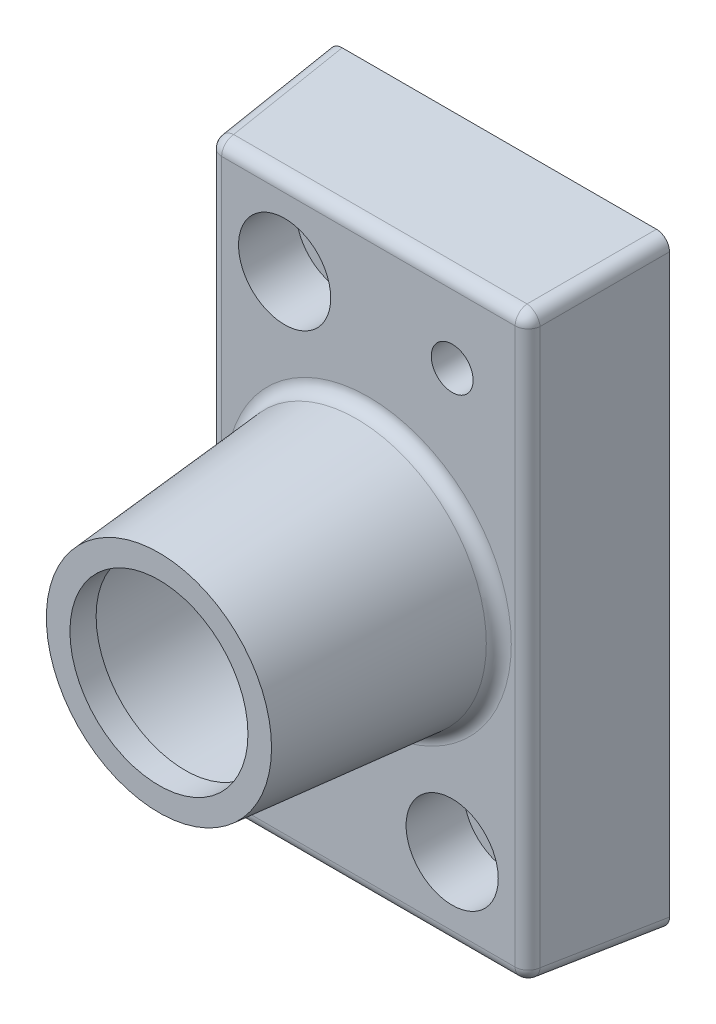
ISO-10303-21;
HEADER;
FILE_DESCRIPTION(('STEP AP214'),'2;1');
FILE_NAME('part.step','',(''),(''),'','','');
FILE_SCHEMA(('AUTOMOTIVE_DESIGN { 1 0 10303 214 1 1 1 1 }'));
ENDSEC;
DATA;
#1=APPLICATION_CONTEXT('core data for automotive mechanical design processes');
#2=APPLICATION_PROTOCOL_DEFINITION('international standard','automotive_design',2000,#1);
#3=PRODUCT_CONTEXT('',#1,'mechanical');
#4=PRODUCT('Part','Part','',(#3));
#5=PRODUCT_RELATED_PRODUCT_CATEGORY('part','',(#4));
#6=PRODUCT_DEFINITION_FORMATION('','',#4);
#7=PRODUCT_DEFINITION_CONTEXT('part definition',#1,'design');
#8=PRODUCT_DEFINITION('design','',#6,#7);
#9=PRODUCT_DEFINITION_SHAPE('','',#8);
#10=(LENGTH_UNIT() NAMED_UNIT(*) SI_UNIT(.MILLI.,.METRE.));
#11=(NAMED_UNIT(*) PLANE_ANGLE_UNIT() SI_UNIT($,.RADIAN.));
#12=(NAMED_UNIT(*) SI_UNIT($,.STERADIAN.) SOLID_ANGLE_UNIT());
#13=UNCERTAINTY_MEASURE_WITH_UNIT(LENGTH_MEASURE(1.E-05),#10,'distance_accuracy_value','');
#14=(GEOMETRIC_REPRESENTATION_CONTEXT(3) GLOBAL_UNCERTAINTY_ASSIGNED_CONTEXT((#13)) GLOBAL_UNIT_ASSIGNED_CONTEXT((#10,
#11,#12)) REPRESENTATION_CONTEXT('',''));
#15=CARTESIAN_POINT('',(0.,0.,0.));
#16=DIRECTION('',(0.,0.,1.));
#17=DIRECTION('',(1.,0.,0.));
#18=AXIS2_PLACEMENT_3D('',#15,#16,#17);
#19=CARTESIAN_POINT('',(-32.4999999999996,57.5,25.));
#20=DIRECTION('',(0.,0.,1.00000000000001));
#21=DIRECTION('',(1.00000000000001,0.,0.));
#22=AXIS2_PLACEMENT_3D('',#19,#20,#21);
#23=PLANE('',#22);
#24=CARTESIAN_POINT('',(-16.0000000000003,-40.,25.));
#25=DIRECTION('',(0.,0.,1.00000000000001));
#26=DIRECTION('',(1.00000000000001,0.,0.));
#27=AXIS2_PLACEMENT_3D('',#24,#25,#26);
#28=CIRCLE('',#27,4.);
#29=CARTESIAN_POINT('',(-12.0000000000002,-40.,25.));
#30=VERTEX_POINT('',#29);
#31=EDGE_CURVE('E537',#30,#30,#28,.T.);
#32=ORIENTED_EDGE('',*,*,#31,.F.);
#33=EDGE_LOOP('',(#32));
#34=FACE_BOUND('',#33,.T.);
#35=CARTESIAN_POINT('',(16.0000000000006,40.,25.));
#36=DIRECTION('',(0.,0.,1.00000000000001));
#37=DIRECTION('',(1.00000000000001,0.,0.));
#38=AXIS2_PLACEMENT_3D('',#35,#36,#37);
#39=CIRCLE('',#38,4.);
#40=CARTESIAN_POINT('',(20.0000000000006,40.,25.));
#41=VERTEX_POINT('',#40);
#42=EDGE_CURVE('E539',#41,#41,#39,.T.);
#43=ORIENTED_EDGE('',*,*,#42,.F.);
#44=EDGE_LOOP('',(#43));
#45=FACE_BOUND('',#44,.T.);
#46=CARTESIAN_POINT('',(16.,-40.,25.));
#47=DIRECTION('',(0.,0.,1.00000000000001));
#48=DIRECTION('',(1.00000000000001,0.,0.));
#49=AXIS2_PLACEMENT_3D('',#46,#47,#48);
#50=CIRCLE('',#49,8.8);
#51=CARTESIAN_POINT('',(24.8000000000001,-40.,25.));
#52=VERTEX_POINT('',#51);
#53=EDGE_CURVE('E556',#52,#52,#50,.T.);
#54=ORIENTED_EDGE('',*,*,#53,.F.);
#55=EDGE_LOOP('',(#54));
#56=FACE_BOUND('',#55,.T.);
#57=CARTESIAN_POINT('',(-15.9999999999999,40.,25.));
#58=DIRECTION('',(0.,0.,1.00000000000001));
#59=DIRECTION('',(1.00000000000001,0.,0.));
#60=AXIS2_PLACEMENT_3D('',#57,#58,#59);
#61=CIRCLE('',#60,8.8);
#62=CARTESIAN_POINT('',(-7.19999999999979,40.0000000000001,25.));
#63=VERTEX_POINT('',#62);
#64=EDGE_CURVE('E568',#63,#63,#61,.T.);
#65=ORIENTED_EDGE('',*,*,#64,.F.);
#66=EDGE_LOOP('',(#65));
#67=FACE_BOUND('',#66,.T.);
#68=CARTESIAN_POINT('',(0.,0.,25.));
#69=DIRECTION('',(0.,0.,1.00000000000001));
#70=DIRECTION('',(1.00000000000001,0.,0.));
#71=AXIS2_PLACEMENT_3D('',#68,#69,#70);
#72=CIRCLE('',#71,27.2908279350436);
#73=CARTESIAN_POINT('',(27.2908279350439,0.,25.));
#74=VERTEX_POINT('',#73);
#75=EDGE_CURVE('E141',#74,#74,#72,.F.);
#76=ORIENTED_EDGE('',*,*,#75,.T.);
#77=EDGE_LOOP('',(#76));
#78=FACE_BOUND('',#77,.T.);
#79=DIRECTION('',(0.,-1.,0.));
#80=VECTOR('',#79,1.);
#81=CARTESIAN_POINT('',(28.021955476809,55.312783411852,25.));
#82=LINE('',#81,#80);
#83=CARTESIAN_POINT('',(28.0219554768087,-53.0219554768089,25.));
#84=VERTEX_POINT('',#83);
#85=CARTESIAN_POINT('',(28.021955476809,53.0219554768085,25.));
#86=VERTEX_POINT('',#85);
#87=EDGE_CURVE('E139',#84,#86,#82,.F.);
#88=ORIENTED_EDGE('',*,*,#87,.T.);
#89=DIRECTION('',(1.00000000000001,0.,0.));
#90=VECTOR('',#89,1.);
#91=CARTESIAN_POINT('',(-30.3127834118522,53.0219554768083,25.));
#92=LINE('',#91,#90);
#93=CARTESIAN_POINT('',(-28.0219554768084,53.0219554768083,25.));
#94=VERTEX_POINT('',#93);
#95=EDGE_CURVE('E111',#86,#94,#92,.F.);
#96=ORIENTED_EDGE('',*,*,#95,.T.);
#97=DIRECTION('',(0.,1.,0.));
#98=VECTOR('',#97,1.);
#99=CARTESIAN_POINT('',(-28.0219554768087,-55.312783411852,25.));
#100=LINE('',#99,#98);
#101=CARTESIAN_POINT('',(-28.0219554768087,-53.0219554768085,25.));
#102=VERTEX_POINT('',#101);
#103=EDGE_CURVE('E129',#94,#102,#100,.F.);
#104=ORIENTED_EDGE('',*,*,#103,.T.);
#105=DIRECTION('',(-1.00000000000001,0.,0.));
#106=VECTOR('',#105,1.);
#107=CARTESIAN_POINT('',(30.3127834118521,-53.0219554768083,25.));
#108=LINE('',#107,#106);
#109=EDGE_CURVE('E135',#102,#84,#108,.F.);
#110=ORIENTED_EDGE('',*,*,#109,.T.);
#111=EDGE_LOOP('',(#88,#96,#104,#110));
#112=FACE_BOUND('',#111,.T.);
#113=ADVANCED_FACE('F29',(#34,#45,#56,#67,#78,#112),#23,.T.);
#114=CARTESIAN_POINT('',(-32.4999999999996,57.5,0.));
#115=DIRECTION('',(-0.996194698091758,0.,0.0871557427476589));
#116=DIRECTION('',(0.0871557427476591,0.,0.996194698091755));
#117=AXIS2_PLACEMENT_3D('',#114,#115,#116);
#118=PLANE('',#117);
#119=DIRECTION('',(0.,-1.,0.));
#120=VECTOR('',#119,1.);
#121=CARTESIAN_POINT('',(-30.5124422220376,55.3127834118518,22.7178893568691));
#122=LINE('',#121,#120);
#123=CARTESIAN_POINT('',(-30.5124422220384,-53.0219554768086,22.7178893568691));
#124=VERTEX_POINT('',#123);
#125=CARTESIAN_POINT('',(-30.512442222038,53.0219554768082,22.7178893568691));
#126=VERTEX_POINT('',#125);
#127=EDGE_CURVE('E45',#124,#126,#122,.F.);
#128=ORIENTED_EDGE('',*,*,#127,.T.);
#129=DIRECTION('',(0.0868265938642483,-0.0868265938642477,0.992432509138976));
#130=VECTOR('',#129,1.);
#131=CARTESIAN_POINT('',(-32.5187754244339,55.0282886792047,-0.214604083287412));
#132=LINE('',#131,#130);
#133=CARTESIAN_POINT('',(-32.4999999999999,55.0095132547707,0.));
#134=VERTEX_POINT('',#133);
#135=EDGE_CURVE('E167',#126,#134,#132,.F.);
#136=ORIENTED_EDGE('',*,*,#135,.T.);
#137=DIRECTION('',(0.,-1.,0.));
#138=VECTOR('',#137,1.);
#139=CARTESIAN_POINT('',(-32.4999999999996,57.5,0.));
#140=LINE('',#139,#138);
#141=CARTESIAN_POINT('',(-32.5000000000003,-55.0095132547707,0.));
#142=VERTEX_POINT('',#141);
#143=EDGE_CURVE('E181',#134,#142,#140,.T.);
#144=ORIENTED_EDGE('',*,*,#143,.T.);
#145=DIRECTION('',(0.0868265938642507,0.0868265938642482,0.992432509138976));
#146=VECTOR('',#145,1.);
#147=CARTESIAN_POINT('',(-31.6518068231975,-54.1613200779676,9.69489237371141));
#148=LINE('',#147,#146);
#149=EDGE_CURVE('E50',#142,#124,#148,.T.);
#150=ORIENTED_EDGE('',*,*,#149,.T.);
#151=EDGE_LOOP('',(#128,#136,#144,#150));
#152=FACE_BOUND('',#151,.T.);
#153=ADVANCED_FACE('F268',(#152),#118,.T.);
#154=CARTESIAN_POINT('',(-32.5000000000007,-57.5000000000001,0.));
#155=DIRECTION('',(0.,-0.996194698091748,0.0871557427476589));
#156=DIRECTION('',(0.,-0.0871557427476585,-0.996194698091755));
#157=AXIS2_PLACEMENT_3D('',#154,#155,#156);
#158=PLANE('',#157);
#159=DIRECTION('',(1.00000000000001,0.,0.));
#160=VECTOR('',#159,1.);
#161=CARTESIAN_POINT('',(-32.5000000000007,-57.5000000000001,0.));
#162=LINE('',#161,#160);
#163=CARTESIAN_POINT('',(-30.0095132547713,-57.5000000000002,0.));
#164=VERTEX_POINT('',#163);
#165=CARTESIAN_POINT('',(30.0095132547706,-57.4999999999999,0.));
#166=VERTEX_POINT('',#165);
#167=EDGE_CURVE('E218',#164,#166,#162,.T.);
#168=ORIENTED_EDGE('',*,*,#167,.T.);
#169=DIRECTION('',(-0.0868265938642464,0.0868265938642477,0.992432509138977));
#170=VECTOR('',#169,1.);
#171=CARTESIAN_POINT('',(29.5382629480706,-57.0287496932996,5.38641565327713));
#172=LINE('',#171,#170);
#173=CARTESIAN_POINT('',(28.0219554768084,-55.5124422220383,22.7178893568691));
#174=VERTEX_POINT('',#173);
#175=EDGE_CURVE('E163',#166,#174,#172,.T.);
#176=ORIENTED_EDGE('',*,*,#175,.T.);
#177=DIRECTION('',(1.00000000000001,0.,0.));
#178=VECTOR('',#177,1.);
#179=CARTESIAN_POINT('',(-30.3127834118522,-55.5124422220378,22.7178893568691));
#180=LINE('',#179,#178);
#181=CARTESIAN_POINT('',(-28.021955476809,-55.5124422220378,22.7178893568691));
#182=VERTEX_POINT('',#181);
#183=EDGE_CURVE('E161',#174,#182,#180,.F.);
#184=ORIENTED_EDGE('',*,*,#183,.T.);
#185=DIRECTION('',(0.0868265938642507,0.0868265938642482,0.992432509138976));
#186=VECTOR('',#185,1.);
#187=CARTESIAN_POINT('',(-30.0282886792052,-57.5187754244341,-0.214604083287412));
#188=LINE('',#187,#186);
#189=EDGE_CURVE('E159',#182,#164,#188,.F.);
#190=ORIENTED_EDGE('',*,*,#189,.T.);
#191=EDGE_LOOP('',(#168,#176,#184,#190));
#192=FACE_BOUND('',#191,.T.);
#193=ADVANCED_FACE('F31',(#192),#158,.T.);
#194=CARTESIAN_POINT('',(32.5000000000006,57.5000000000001,0.));
#195=DIRECTION('',(0.996194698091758,0.,0.0871557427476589));
#196=DIRECTION('',(0.0871557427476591,0.,-0.996194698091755));
#197=AXIS2_PLACEMENT_3D('',#194,#195,#196);
#198=PLANE('',#197);
#199=DIRECTION('',(0.,1.,0.));
#200=VECTOR('',#199,1.);
#201=CARTESIAN_POINT('',(32.5000000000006,57.5000000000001,0.));
#202=LINE('',#201,#200);
#203=CARTESIAN_POINT('',(32.5000000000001,-55.0095132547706,0.));
#204=VERTEX_POINT('',#203);
#205=CARTESIAN_POINT('',(32.5000000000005,55.0095132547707,0.));
#206=VERTEX_POINT('',#205);
#207=EDGE_CURVE('E187',#204,#206,#202,.T.);
#208=ORIENTED_EDGE('',*,*,#207,.T.);
#209=DIRECTION('',(-0.0868265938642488,-0.0868265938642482,0.992432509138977));
#210=VECTOR('',#209,1.);
#211=CARTESIAN_POINT('',(32.5187754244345,55.0282886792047,-0.214604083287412));
#212=LINE('',#211,#210);
#213=CARTESIAN_POINT('',(30.512442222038,53.0219554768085,22.7178893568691));
#214=VERTEX_POINT('',#213);
#215=EDGE_CURVE('E157',#206,#214,#212,.T.);
#216=ORIENTED_EDGE('',*,*,#215,.T.);
#217=DIRECTION('',(0.,1.,0.));
#218=VECTOR('',#217,1.);
#219=CARTESIAN_POINT('',(30.5124422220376,-55.3127834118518,22.7178893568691));
#220=LINE('',#219,#218);
#221=CARTESIAN_POINT('',(30.5124422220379,-53.0219554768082,22.7178893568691));
#222=VERTEX_POINT('',#221);
#223=EDGE_CURVE('E155',#214,#222,#220,.F.);
#224=ORIENTED_EDGE('',*,*,#223,.T.);
#225=DIRECTION('',(-0.0868265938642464,0.0868265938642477,0.992432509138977));
#226=VECTOR('',#225,1.);
#227=CARTESIAN_POINT('',(31.6518068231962,-54.161320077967,9.69489237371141));
#228=LINE('',#227,#226);
#229=EDGE_CURVE('E153',#222,#204,#228,.F.);
#230=ORIENTED_EDGE('',*,*,#229,.T.);
#231=EDGE_LOOP('',(#208,#216,#224,#230));
#232=FACE_BOUND('',#231,.T.);
#233=ADVANCED_FACE('F246',(#232),#198,.T.);
#234=CARTESIAN_POINT('',(-32.4999999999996,57.5,0.));
#235=DIRECTION('',(0.,0.996194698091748,0.0871557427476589));
#236=DIRECTION('',(0.,-0.0871557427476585,0.996194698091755));
#237=AXIS2_PLACEMENT_3D('',#234,#235,#236);
#238=PLANE('',#237);
#239=DIRECTION('',(-1.00000000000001,0.,0.));
#240=VECTOR('',#239,1.);
#241=CARTESIAN_POINT('',(30.3127834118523,55.5124422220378,22.7178893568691));
#242=LINE('',#241,#240);
#243=CARTESIAN_POINT('',(-28.0219554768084,55.5124422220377,22.7178893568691));
#244=VERTEX_POINT('',#243);
#245=CARTESIAN_POINT('',(28.021955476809,55.5124422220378,22.7178893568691));
#246=VERTEX_POINT('',#245);
#247=EDGE_CURVE('E113',#244,#246,#242,.F.);
#248=ORIENTED_EDGE('',*,*,#247,.T.);
#249=DIRECTION('',(-0.0868265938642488,-0.0868265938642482,0.992432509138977));
#250=VECTOR('',#249,1.);
#251=CARTESIAN_POINT('',(29.538262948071,57.0287496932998,5.38641565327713));
#252=LINE('',#251,#250);
#253=CARTESIAN_POINT('',(30.0095132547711,57.5000000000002,0.));
#254=VERTEX_POINT('',#253);
#255=EDGE_CURVE('E151',#246,#254,#252,.F.);
#256=ORIENTED_EDGE('',*,*,#255,.T.);
#257=DIRECTION('',(-1.00000000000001,0.,0.));
#258=VECTOR('',#257,1.);
#259=CARTESIAN_POINT('',(-32.4999999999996,57.5,0.));
#260=LINE('',#259,#258);
#261=CARTESIAN_POINT('',(-30.0095132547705,57.4999999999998,0.));
#262=VERTEX_POINT('',#261);
#263=EDGE_CURVE('E179',#254,#262,#260,.T.);
#264=ORIENTED_EDGE('',*,*,#263,.T.);
#265=DIRECTION('',(0.0868265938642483,-0.0868265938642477,0.992432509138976));
#266=VECTOR('',#265,1.);
#267=CARTESIAN_POINT('',(-30.0282886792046,57.5187754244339,-0.214604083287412));
#268=LINE('',#267,#266);
#269=EDGE_CURVE('E144',#262,#244,#268,.T.);
#270=ORIENTED_EDGE('',*,*,#269,.T.);
#271=EDGE_LOOP('',(#248,#256,#264,#270));
#272=FACE_BOUND('',#271,.T.);
#273=ADVANCED_FACE('F185',(#272),#238,.T.);
#274=CARTESIAN_POINT('',(-32.4999999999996,57.5,0.));
#275=DIRECTION('',(0.,0.,1.00000000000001));
#276=DIRECTION('',(1.00000000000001,0.,0.));
#277=AXIS2_PLACEMENT_3D('',#274,#275,#276);
#278=PLANE('',#277);
#279=CARTESIAN_POINT('',(-16.0000000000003,-40.,0.));
#280=DIRECTION('',(0.,0.,1.00000000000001));
#281=DIRECTION('',(1.00000000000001,0.,0.));
#282=AXIS2_PLACEMENT_3D('',#279,#280,#281);
#283=CIRCLE('',#282,4.);
#284=CARTESIAN_POINT('',(-12.0000000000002,-40.,0.));
#285=VERTEX_POINT('',#284);
#286=EDGE_CURVE('E535',#285,#285,#283,.T.);
#287=ORIENTED_EDGE('',*,*,#286,.T.);
#288=EDGE_LOOP('',(#287));
#289=FACE_BOUND('',#288,.T.);
#290=CARTESIAN_POINT('',(16.0000000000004,40.,0.));
#291=DIRECTION('',(0.,0.,1.00000000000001));
#292=DIRECTION('',(1.00000000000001,0.,0.));
#293=AXIS2_PLACEMENT_3D('',#290,#291,#292);
#294=CIRCLE('',#293,4.);
#295=CARTESIAN_POINT('',(20.0000000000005,40.,0.));
#296=VERTEX_POINT('',#295);
#297=EDGE_CURVE('E544',#296,#296,#294,.T.);
#298=ORIENTED_EDGE('',*,*,#297,.T.);
#299=EDGE_LOOP('',(#298));
#300=FACE_BOUND('',#299,.T.);
#301=CARTESIAN_POINT('',(16.,-40.,1.36418654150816E-10));
#302=DIRECTION('',(0.,0.,1.00000000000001));
#303=DIRECTION('',(1.00000000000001,0.,0.));
#304=AXIS2_PLACEMENT_3D('',#301,#302,#303);
#305=CIRCLE('',#304,5.49999999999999);
#306=CARTESIAN_POINT('',(21.5000000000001,-40.,1.36418654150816E-10));
#307=VERTEX_POINT('',#306);
#308=EDGE_CURVE('E547',#307,#307,#305,.T.);
#309=ORIENTED_EDGE('',*,*,#308,.T.);
#310=EDGE_LOOP('',(#309));
#311=FACE_BOUND('',#310,.T.);
#312=CARTESIAN_POINT('',(-16.0000000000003,40.,1.36418654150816E-10));
#313=DIRECTION('',(0.,0.,1.00000000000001));
#314=DIRECTION('',(1.00000000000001,0.,0.));
#315=AXIS2_PLACEMENT_3D('',#312,#313,#314);
#316=CIRCLE('',#315,5.49999999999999);
#317=CARTESIAN_POINT('',(-10.5000000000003,40.,1.36418654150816E-10));
#318=VERTEX_POINT('',#317);
#319=EDGE_CURVE('E559',#318,#318,#316,.T.);
#320=ORIENTED_EDGE('',*,*,#319,.T.);
#321=EDGE_LOOP('',(#320));
#322=FACE_BOUND('',#321,.T.);
#323=CARTESIAN_POINT('',(0.,0.,0.));
#324=DIRECTION('',(0.,0.,-1.00000000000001));
#325=DIRECTION('',(-1.00000000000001,0.,0.));
#326=AXIS2_PLACEMENT_3D('',#323,#324,#325);
#327=CIRCLE('',#326,20.);
#328=CARTESIAN_POINT('',(-20.0000000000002,0.,0.));
#329=VERTEX_POINT('',#328);
#330=EDGE_CURVE('E574',#329,#329,#327,.T.);
#331=ORIENTED_EDGE('',*,*,#330,.F.);
#332=EDGE_LOOP('',(#331));
#333=FACE_BOUND('',#332,.T.);
#334=ORIENTED_EDGE('',*,*,#263,.F.);
#335=CARTESIAN_POINT('',(29.9904504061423,54.9904504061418,0.));
#336=DIRECTION('',(0.,0.,1.00000000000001));
#337=DIRECTION('',(0.707106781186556,0.707106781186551,0.));
#338=AXIS2_PLACEMENT_3D('',#335,#336,#337);
#339=ELLIPSE('',#338,2.51906298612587,2.5);
#340=EDGE_CURVE('E11',#254,#206,#339,.F.);
#341=ORIENTED_EDGE('',*,*,#340,.T.);
#342=ORIENTED_EDGE('',*,*,#207,.F.);
#343=CARTESIAN_POINT('',(29.990450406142,-54.9904504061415,0.));
#344=DIRECTION('',(0.,0.,1.00000000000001));
#345=DIRECTION('',(0.707106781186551,-0.707106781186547,0.));
#346=AXIS2_PLACEMENT_3D('',#343,#344,#345);
#347=ELLIPSE('',#346,2.51906298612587,2.5);
#348=EDGE_CURVE('E171',#204,#166,#347,.F.);
#349=ORIENTED_EDGE('',*,*,#348,.T.);
#350=ORIENTED_EDGE('',*,*,#167,.F.);
#351=CARTESIAN_POINT('',(-29.990450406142,-54.9904504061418,0.));
#352=DIRECTION('',(0.,0.,1.00000000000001));
#353=DIRECTION('',(-0.707106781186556,-0.707106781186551,0.));
#354=AXIS2_PLACEMENT_3D('',#351,#352,#353);
#355=ELLIPSE('',#354,2.51906298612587,2.5);
#356=EDGE_CURVE('E169',#164,#142,#355,.F.);
#357=ORIENTED_EDGE('',*,*,#356,.T.);
#358=ORIENTED_EDGE('',*,*,#143,.F.);
#359=CARTESIAN_POINT('',(-29.9904504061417,54.9904504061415,0.));
#360=DIRECTION('',(0.,0.,1.00000000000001));
#361=DIRECTION('',(-0.707106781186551,0.707106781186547,0.));
#362=AXIS2_PLACEMENT_3D('',#359,#360,#361);
#363=ELLIPSE('',#362,2.51906298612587,2.5);
#364=EDGE_CURVE('E38',#134,#262,#363,.F.);
#365=ORIENTED_EDGE('',*,*,#364,.T.);
#366=EDGE_LOOP('',(#334,#341,#342,#349,#350,#357,#358,#365));
#367=FACE_BOUND('',#366,.T.);
#368=ADVANCED_FACE('F178',(#289,#300,#311,#322,#333,#367),#278,.F.);
#369=CARTESIAN_POINT('',(0.,0.,25.));
#370=DIRECTION('',(0.,0.,-1.00000000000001));
#371=DIRECTION('',(1.00000000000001,0.,0.));
#372=AXIS2_PLACEMENT_3D('',#369,#370,#371);
#373=CONICAL_SURFACE('',#372,25.,0.0872664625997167);
#374=CARTESIAN_POINT('',(0.,0.,27.2821106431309));
#375=DIRECTION('',(0.,0.,1.00000000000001));
#376=DIRECTION('',(1.00000000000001,0.,0.));
#377=AXIS2_PLACEMENT_3D('',#374,#375,#376);
#378=CIRCLE('',#377,24.8003411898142);
#379=CARTESIAN_POINT('',(24.8003411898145,0.,27.2821106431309));
#380=VERTEX_POINT('',#379);
#381=EDGE_CURVE('E136',#380,#380,#378,.T.);
#382=ORIENTED_EDGE('',*,*,#381,.T.);
#383=EDGE_LOOP('',(#382));
#384=FACE_BOUND('',#383,.T.);
#385=CARTESIAN_POINT('',(0.,0.,65.));
#386=DIRECTION('',(0.,0.,1.00000000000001));
#387=DIRECTION('',(1.00000000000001,0.,0.));
#388=AXIS2_PLACEMENT_3D('',#385,#386,#387);
#389=CIRCLE('',#388,21.500453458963);
#390=CARTESIAN_POINT('',(21.5004534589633,0.,65.));
#391=VERTEX_POINT('',#390);
#392=EDGE_CURVE('E214',#391,#391,#389,.T.);
#393=ORIENTED_EDGE('',*,*,#392,.F.);
#394=EDGE_LOOP('',(#393));
#395=FACE_BOUND('',#394,.T.);
#396=ADVANCED_FACE('F311',(#384,#395),#373,.T.);
#397=CARTESIAN_POINT('',(0.,0.,65.));
#398=DIRECTION('',(0.,0.,1.00000000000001));
#399=DIRECTION('',(1.00000000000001,0.,0.));
#400=AXIS2_PLACEMENT_3D('',#397,#398,#399);
#401=PLANE('',#400);
#402=CARTESIAN_POINT('',(0.,0.,65.));
#403=DIRECTION('',(0.,0.,1.00000000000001));
#404=DIRECTION('',(1.00000000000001,0.,0.));
#405=AXIS2_PLACEMENT_3D('',#402,#403,#404);
#406=CIRCLE('',#405,17.);
#407=CARTESIAN_POINT('',(17.0000000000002,0.,65.));
#408=VERTEX_POINT('',#407);
#409=EDGE_CURVE('E571',#408,#408,#406,.T.);
#410=ORIENTED_EDGE('',*,*,#409,.F.);
#411=EDGE_LOOP('',(#410));
#412=FACE_BOUND('',#411,.T.);
#413=ORIENTED_EDGE('',*,*,#392,.T.);
#414=EDGE_LOOP('',(#413));
#415=FACE_BOUND('',#414,.T.);
#416=ADVANCED_FACE('F323',(#412,#415),#401,.T.);
#417=CARTESIAN_POINT('',(0.,0.,27.5));
#418=DIRECTION('',(0.,0.,1.00000000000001));
#419=DIRECTION('',(1.00000000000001,0.,0.));
#420=AXIS2_PLACEMENT_3D('',#417,#418,#419);
#421=TOROIDAL_SURFACE('',#420,27.2908279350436,2.5);
#422=ORIENTED_EDGE('',*,*,#75,.F.);
#423=EDGE_LOOP('',(#422));
#424=FACE_BOUND('',#423,.T.);
#425=ORIENTED_EDGE('',*,*,#381,.F.);
#426=EDGE_LOOP('',(#425));
#427=FACE_BOUND('',#426,.T.);
#428=ADVANCED_FACE('F329',(#424,#427),#421,.F.);
#429=CARTESIAN_POINT('',(29.161320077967,-54.161320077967,9.47700301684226));
#430=DIRECTION('',(0.0868265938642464,-0.0868265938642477,-0.992432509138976));
#431=DIRECTION('',(-0.996194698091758,0.,-0.087155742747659));
#432=AXIS2_PLACEMENT_3D('',#429,#430,#431);
#433=CYLINDRICAL_SURFACE('',#432,2.5);
#434=ORIENTED_EDGE('',*,*,#348,.F.);
#435=ORIENTED_EDGE('',*,*,#229,.F.);
#436=CARTESIAN_POINT('',(28.0219554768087,-53.0219554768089,22.5));
#437=DIRECTION('',(-0.0868265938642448,0.086826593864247,0.992432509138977));
#438=DIRECTION('',(0.,-0.996194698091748,0.0871557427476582));
#439=AXIS2_PLACEMENT_3D('',#436,#437,#438);
#440=CIRCLE('',#439,2.5);
#441=EDGE_CURVE('E211',#174,#222,#440,.T.);
#442=ORIENTED_EDGE('',*,*,#441,.F.);
#443=ORIENTED_EDGE('',*,*,#175,.F.);
#444=EDGE_LOOP('',(#434,#435,#442,#443));
#445=FACE_BOUND('',#444,.T.);
#446=ADVANCED_FACE('F249',(#445),#433,.T.);
#447=CARTESIAN_POINT('',(-32.5000000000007,-53.0219554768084,22.5));
#448=DIRECTION('',(1.00000000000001,0.,0.));
#449=DIRECTION('',(0.,1.,0.));
#450=AXIS2_PLACEMENT_3D('',#447,#448,#449);
#451=CYLINDRICAL_SURFACE('',#450,2.5);
#452=CARTESIAN_POINT('',(-28.0219554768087,-53.0219554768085,22.5));
#453=DIRECTION('',(-1.00000000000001,0.,0.));
#454=DIRECTION('',(0.,0.,1.00000000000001));
#455=AXIS2_PLACEMENT_3D('',#452,#453,#454);
#456=CIRCLE('',#455,2.5);
#457=EDGE_CURVE('E205',#182,#102,#456,.T.);
#458=ORIENTED_EDGE('',*,*,#457,.F.);
#459=ORIENTED_EDGE('',*,*,#183,.F.);
#460=CARTESIAN_POINT('',(28.0219554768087,-53.0219554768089,22.5));
#461=DIRECTION('',(1.00000000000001,0.,0.));
#462=DIRECTION('',(0.,0.,-1.00000000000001));
#463=AXIS2_PLACEMENT_3D('',#460,#461,#462);
#464=CIRCLE('',#463,2.5);
#465=EDGE_CURVE('E208',#84,#174,#464,.T.);
#466=ORIENTED_EDGE('',*,*,#465,.F.);
#467=ORIENTED_EDGE('',*,*,#109,.F.);
#468=EDGE_LOOP('',(#458,#459,#466,#467));
#469=FACE_BOUND('',#468,.T.);
#470=ADVANCED_FACE('F229',(#469),#451,.T.);
#471=CARTESIAN_POINT('',(-30.0282886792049,-55.0282886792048,-0.432493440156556));
#472=DIRECTION('',(-0.0868265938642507,-0.0868265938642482,-0.992432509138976));
#473=DIRECTION('',(-0.996194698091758,0.,0.087155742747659));
#474=AXIS2_PLACEMENT_3D('',#471,#472,#473);
#475=CYLINDRICAL_SURFACE('',#474,2.5);
#476=ORIENTED_EDGE('',*,*,#356,.F.);
#477=ORIENTED_EDGE('',*,*,#189,.F.);
#478=CARTESIAN_POINT('',(-28.0219554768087,-53.0219554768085,22.5));
#479=DIRECTION('',(0.08682659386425,0.0868265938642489,0.992432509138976));
#480=DIRECTION('',(0.,-0.996194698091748,0.0871557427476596));
#481=AXIS2_PLACEMENT_3D('',#478,#479,#480);
#482=CIRCLE('',#481,2.5);
#483=EDGE_CURVE('E202',#124,#182,#482,.T.);
#484=ORIENTED_EDGE('',*,*,#483,.F.);
#485=ORIENTED_EDGE('',*,*,#149,.F.);
#486=EDGE_LOOP('',(#476,#477,#484,#485));
#487=FACE_BOUND('',#486,.T.);
#488=ADVANCED_FACE('F256',(#487),#475,.T.);
#489=CARTESIAN_POINT('',(28.0219554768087,-53.0219554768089,22.5));
#490=DIRECTION('',(0.,0.,1.00000000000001));
#491=DIRECTION('',(1.00000000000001,0.,0.));
#492=AXIS2_PLACEMENT_3D('',#489,#490,#491);
#493=SPHERICAL_SURFACE('',#492,2.5);
#494=ORIENTED_EDGE('',*,*,#465,.T.);
#495=ORIENTED_EDGE('',*,*,#441,.T.);
#496=CARTESIAN_POINT('',(28.0219554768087,-53.0219554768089,22.5));
#497=DIRECTION('',(0.,-1.,0.));
#498=DIRECTION('',(0.,0.,-1.00000000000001));
#499=AXIS2_PLACEMENT_3D('',#496,#497,#498);
#500=CIRCLE('',#499,2.5);
#501=EDGE_CURVE('E199',#84,#222,#500,.F.);
#502=ORIENTED_EDGE('',*,*,#501,.F.);
#503=EDGE_LOOP('',(#494,#495,#502));
#504=FACE_BOUND('',#503,.T.);
#505=ADVANCED_FACE('F232',(#504),#493,.T.);
#506=CARTESIAN_POINT('',(-28.0219554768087,-53.0219554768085,22.5));
#507=DIRECTION('',(0.,0.,1.00000000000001));
#508=DIRECTION('',(1.00000000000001,0.,0.));
#509=AXIS2_PLACEMENT_3D('',#506,#507,#508);
#510=SPHERICAL_SURFACE('',#509,2.5);
#511=ORIENTED_EDGE('',*,*,#483,.T.);
#512=ORIENTED_EDGE('',*,*,#457,.T.);
#513=CARTESIAN_POINT('',(-28.0219554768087,-53.0219554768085,22.5));
#514=DIRECTION('',(0.,-1.,0.));
#515=DIRECTION('',(1.00000000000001,0.,0.));
#516=AXIS2_PLACEMENT_3D('',#513,#514,#515);
#517=CIRCLE('',#516,2.5);
#518=EDGE_CURVE('E132',#124,#102,#517,.F.);
#519=ORIENTED_EDGE('',*,*,#518,.F.);
#520=EDGE_LOOP('',(#511,#512,#519));
#521=FACE_BOUND('',#520,.T.);
#522=ADVANCED_FACE('F258',(#521),#510,.T.);
#523=CARTESIAN_POINT('',(29.5382629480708,54.5382629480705,5.16852629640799));
#524=DIRECTION('',(0.0868265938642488,0.0868265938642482,-0.992432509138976));
#525=DIRECTION('',(0.,0.996194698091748,0.087155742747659));
#526=AXIS2_PLACEMENT_3D('',#523,#524,#525);
#527=CYLINDRICAL_SURFACE('',#526,2.5);
#528=ORIENTED_EDGE('',*,*,#340,.F.);
#529=ORIENTED_EDGE('',*,*,#255,.F.);
#530=CARTESIAN_POINT('',(28.021955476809,53.0219554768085,22.5));
#531=DIRECTION('',(-0.0868265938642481,-0.0868265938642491,0.992432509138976));
#532=DIRECTION('',(0.,-0.996194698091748,-0.0871557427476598));
#533=AXIS2_PLACEMENT_3D('',#530,#531,#532);
#534=CIRCLE('',#533,2.5);
#535=EDGE_CURVE('E195',#214,#246,#534,.T.);
#536=ORIENTED_EDGE('',*,*,#535,.F.);
#537=ORIENTED_EDGE('',*,*,#215,.F.);
#538=EDGE_LOOP('',(#528,#529,#536,#537));
#539=FACE_BOUND('',#538,.T.);
#540=ADVANCED_FACE('F242',(#539),#527,.T.);
#541=CARTESIAN_POINT('',(28.0219554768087,57.5000000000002,22.5));
#542=DIRECTION('',(0.,1.,0.));
#543=DIRECTION('',(-1.00000000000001,0.,0.));
#544=AXIS2_PLACEMENT_3D('',#541,#542,#543);
#545=CYLINDRICAL_SURFACE('',#544,2.5);
#546=ORIENTED_EDGE('',*,*,#501,.T.);
#547=ORIENTED_EDGE('',*,*,#223,.F.);
#548=CARTESIAN_POINT('',(28.021955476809,53.0219554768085,22.5));
#549=DIRECTION('',(0.,1.,0.));
#550=DIRECTION('',(-1.00000000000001,0.,0.));
#551=AXIS2_PLACEMENT_3D('',#548,#549,#550);
#552=CIRCLE('',#551,2.5);
#553=EDGE_CURVE('E126',#86,#214,#552,.T.);
#554=ORIENTED_EDGE('',*,*,#553,.F.);
#555=ORIENTED_EDGE('',*,*,#87,.F.);
#556=EDGE_LOOP('',(#546,#547,#554,#555));
#557=FACE_BOUND('',#556,.T.);
#558=ADVANCED_FACE('F235',(#557),#545,.T.);
#559=CARTESIAN_POINT('',(-28.0219554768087,57.4999999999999,22.5));
#560=DIRECTION('',(0.,-1.,0.));
#561=DIRECTION('',(1.00000000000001,0.,0.));
#562=AXIS2_PLACEMENT_3D('',#559,#560,#561);
#563=CYLINDRICAL_SURFACE('',#562,2.5);
#564=ORIENTED_EDGE('',*,*,#518,.T.);
#565=ORIENTED_EDGE('',*,*,#103,.F.);
#566=CARTESIAN_POINT('',(-28.0219554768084,53.0219554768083,22.5));
#567=DIRECTION('',(0.,1.,0.));
#568=DIRECTION('',(0.,0.,1.00000000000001));
#569=AXIS2_PLACEMENT_3D('',#566,#567,#568);
#570=CIRCLE('',#569,2.5);
#571=EDGE_CURVE('E120',#126,#94,#570,.T.);
#572=ORIENTED_EDGE('',*,*,#571,.F.);
#573=ORIENTED_EDGE('',*,*,#127,.F.);
#574=EDGE_LOOP('',(#564,#565,#572,#573));
#575=FACE_BOUND('',#574,.T.);
#576=ADVANCED_FACE('F130',(#575),#563,.T.);
#577=CARTESIAN_POINT('',(-30.0282886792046,55.0282886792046,-0.432493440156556));
#578=DIRECTION('',(-0.0868265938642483,0.0868265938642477,-0.992432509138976));
#579=DIRECTION('',(-0.996194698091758,0.,0.087155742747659));
#580=AXIS2_PLACEMENT_3D('',#577,#578,#579);
#581=CYLINDRICAL_SURFACE('',#580,2.5);
#582=ORIENTED_EDGE('',*,*,#364,.F.);
#583=ORIENTED_EDGE('',*,*,#135,.F.);
#584=CARTESIAN_POINT('',(-28.0219554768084,53.0219554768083,22.5));
#585=DIRECTION('',(0.0868265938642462,-0.086826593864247,0.992432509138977));
#586=DIRECTION('',(0.,-0.996194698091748,-0.0871557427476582));
#587=AXIS2_PLACEMENT_3D('',#584,#585,#586);
#588=CIRCLE('',#587,2.5);
#589=EDGE_CURVE('E124',#244,#126,#588,.T.);
#590=ORIENTED_EDGE('',*,*,#589,.F.);
#591=ORIENTED_EDGE('',*,*,#269,.F.);
#592=EDGE_LOOP('',(#582,#583,#590,#591));
#593=FACE_BOUND('',#592,.T.);
#594=ADVANCED_FACE('F189',(#593),#581,.T.);
#595=CARTESIAN_POINT('',(28.021955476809,53.0219554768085,22.5));
#596=DIRECTION('',(0.,0.,1.00000000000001));
#597=DIRECTION('',(1.00000000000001,0.,0.));
#598=AXIS2_PLACEMENT_3D('',#595,#596,#597);
#599=SPHERICAL_SURFACE('',#598,2.5);
#600=ORIENTED_EDGE('',*,*,#553,.T.);
#601=ORIENTED_EDGE('',*,*,#535,.T.);
#602=CARTESIAN_POINT('',(28.021955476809,53.0219554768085,22.5));
#603=DIRECTION('',(1.00000000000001,0.,0.));
#604=DIRECTION('',(0.,0.,-1.00000000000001));
#605=AXIS2_PLACEMENT_3D('',#602,#603,#604);
#606=CIRCLE('',#605,2.5);
#607=EDGE_CURVE('E116',#86,#246,#606,.F.);
#608=ORIENTED_EDGE('',*,*,#607,.F.);
#609=EDGE_LOOP('',(#600,#601,#608));
#610=FACE_BOUND('',#609,.T.);
#611=ADVANCED_FACE('F239',(#610),#599,.T.);
#612=CARTESIAN_POINT('',(-28.0219554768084,53.0219554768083,22.5));
#613=DIRECTION('',(0.,0.,1.00000000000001));
#614=DIRECTION('',(1.00000000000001,0.,0.));
#615=AXIS2_PLACEMENT_3D('',#612,#613,#614);
#616=SPHERICAL_SURFACE('',#615,2.5);
#617=ORIENTED_EDGE('',*,*,#589,.T.);
#618=ORIENTED_EDGE('',*,*,#571,.T.);
#619=CARTESIAN_POINT('',(-28.0219554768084,53.0219554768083,22.5));
#620=DIRECTION('',(-1.00000000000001,0.,0.));
#621=DIRECTION('',(0.,0.,1.00000000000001));
#622=AXIS2_PLACEMENT_3D('',#619,#620,#621);
#623=CIRCLE('',#622,2.5);
#624=EDGE_CURVE('E107',#244,#94,#623,.F.);
#625=ORIENTED_EDGE('',*,*,#624,.F.);
#626=EDGE_LOOP('',(#617,#618,#625));
#627=FACE_BOUND('',#626,.T.);
#628=ADVANCED_FACE('F122',(#627),#616,.T.);
#629=CARTESIAN_POINT('',(-32.5000000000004,53.0219554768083,22.5));
#630=DIRECTION('',(-1.00000000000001,0.,0.));
#631=DIRECTION('',(0.,0.,1.00000000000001));
#632=AXIS2_PLACEMENT_3D('',#629,#630,#631);
#633=CYLINDRICAL_SURFACE('',#632,2.5);
#634=ORIENTED_EDGE('',*,*,#607,.T.);
#635=ORIENTED_EDGE('',*,*,#247,.F.);
#636=ORIENTED_EDGE('',*,*,#624,.T.);
#637=ORIENTED_EDGE('',*,*,#95,.F.);
#638=EDGE_LOOP('',(#634,#635,#636,#637));
#639=FACE_BOUND('',#638,.T.);
#640=ADVANCED_FACE('F109',(#639),#633,.T.);
#641=CARTESIAN_POINT('',(0.,0.,60.));
#642=DIRECTION('',(0.,0.,-1.00000000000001));
#643=DIRECTION('',(-1.00000000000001,0.,0.));
#644=AXIS2_PLACEMENT_3D('',#641,#642,#643);
#645=CYLINDRICAL_SURFACE('',#644,20.);
#646=CARTESIAN_POINT('',(0.,0.,60.));
#647=DIRECTION('',(0.,0.,-1.00000000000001));
#648=DIRECTION('',(-1.00000000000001,0.,0.));
#649=AXIS2_PLACEMENT_3D('',#646,#647,#648);
#650=CIRCLE('',#649,20.);
#651=CARTESIAN_POINT('',(-20.0000000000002,0.,60.));
#652=VERTEX_POINT('',#651);
#653=EDGE_CURVE('E117',#652,#652,#650,.T.);
#654=ORIENTED_EDGE('',*,*,#653,.F.);
#655=EDGE_LOOP('',(#654));
#656=FACE_BOUND('',#655,.T.);
#657=ORIENTED_EDGE('',*,*,#330,.T.);
#658=EDGE_LOOP('',(#657));
#659=FACE_BOUND('',#658,.T.);
#660=ADVANCED_FACE('F419',(#656,#659),#645,.F.);
#661=CARTESIAN_POINT('',(0.,0.,60.));
#662=DIRECTION('',(0.,0.,-1.00000000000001));
#663=DIRECTION('',(-1.00000000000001,0.,0.));
#664=AXIS2_PLACEMENT_3D('',#661,#662,#663);
#665=PLANE('',#664);
#666=CARTESIAN_POINT('',(0.,0.,60.));
#667=DIRECTION('',(0.,0.,-1.00000000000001));
#668=DIRECTION('',(-1.00000000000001,0.,0.));
#669=AXIS2_PLACEMENT_3D('',#666,#667,#668);
#670=CIRCLE('',#669,17.);
#671=CARTESIAN_POINT('',(-17.0000000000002,0.,60.));
#672=VERTEX_POINT('',#671);
#673=EDGE_CURVE('E33',#672,#672,#670,.T.);
#674=ORIENTED_EDGE('',*,*,#673,.F.);
#675=EDGE_LOOP('',(#674));
#676=FACE_BOUND('',#675,.T.);
#677=ORIENTED_EDGE('',*,*,#653,.T.);
#678=EDGE_LOOP('',(#677));
#679=FACE_BOUND('',#678,.T.);
#680=ADVANCED_FACE('F428',(#676,#679),#665,.T.);
#681=CARTESIAN_POINT('',(0.,0.,0.));
#682=DIRECTION('',(0.,0.,1.00000000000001));
#683=DIRECTION('',(1.00000000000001,0.,0.));
#684=AXIS2_PLACEMENT_3D('',#681,#682,#683);
#685=CYLINDRICAL_SURFACE('',#684,17.);
#686=ORIENTED_EDGE('',*,*,#673,.T.);
#687=EDGE_LOOP('',(#686));
#688=FACE_BOUND('',#687,.T.);
#689=ORIENTED_EDGE('',*,*,#409,.T.);
#690=EDGE_LOOP('',(#689));
#691=FACE_BOUND('',#690,.T.);
#692=ADVANCED_FACE('F438',(#688,#691),#685,.F.);
#693=CARTESIAN_POINT('',(-15.9999999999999,40.,25.));
#694=DIRECTION('',(0.,0.,1.00000000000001));
#695=DIRECTION('',(1.00000000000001,0.,0.));
#696=AXIS2_PLACEMENT_3D('',#693,#694,#695);
#697=CYLINDRICAL_SURFACE('',#696,8.8);
#698=CARTESIAN_POINT('',(-16.0000000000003,40.,14.));
#699=DIRECTION('',(0.,0.,1.00000000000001));
#700=DIRECTION('',(1.00000000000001,0.,0.));
#701=AXIS2_PLACEMENT_3D('',#698,#699,#700);
#702=CIRCLE('',#701,8.8);
#703=CARTESIAN_POINT('',(-7.20000000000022,40.0000000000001,14.));
#704=VERTEX_POINT('',#703);
#705=EDGE_CURVE('E565',#704,#704,#702,.T.);
#706=ORIENTED_EDGE('',*,*,#705,.F.);
#707=EDGE_LOOP('',(#706));
#708=FACE_BOUND('',#707,.T.);
#709=ORIENTED_EDGE('',*,*,#64,.T.);
#710=EDGE_LOOP('',(#709));
#711=FACE_BOUND('',#710,.T.);
#712=ADVANCED_FACE('F448',(#708,#711),#697,.F.);
#713=CARTESIAN_POINT('',(-10.5,40.,14.));
#714=DIRECTION('',(0.,0.,-1.00000000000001));
#715=DIRECTION('',(-1.00000000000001,0.,0.));
#716=AXIS2_PLACEMENT_3D('',#713,#714,#715);
#717=PLANE('',#716);
#718=CARTESIAN_POINT('',(-16.0000000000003,40.,14.));
#719=DIRECTION('',(0.,0.,1.00000000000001));
#720=DIRECTION('',(1.00000000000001,0.,0.));
#721=AXIS2_PLACEMENT_3D('',#718,#719,#720);
#722=CIRCLE('',#721,5.5);
#723=CARTESIAN_POINT('',(-10.5000000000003,40.,14.));
#724=VERTEX_POINT('',#723);
#725=EDGE_CURVE('E562',#724,#724,#722,.T.);
#726=ORIENTED_EDGE('',*,*,#725,.F.);
#727=EDGE_LOOP('',(#726));
#728=FACE_BOUND('',#727,.T.);
#729=ORIENTED_EDGE('',*,*,#705,.T.);
#730=EDGE_LOOP('',(#729));
#731=FACE_BOUND('',#730,.T.);
#732=ADVANCED_FACE('F458',(#728,#731),#717,.F.);
#733=CARTESIAN_POINT('',(-15.9999999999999,40.,25.));
#734=DIRECTION('',(0.,0.,1.00000000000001));
#735=DIRECTION('',(1.00000000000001,0.,0.));
#736=AXIS2_PLACEMENT_3D('',#733,#734,#735);
#737=CYLINDRICAL_SURFACE('',#736,5.5);
#738=ORIENTED_EDGE('',*,*,#319,.F.);
#739=EDGE_LOOP('',(#738));
#740=FACE_BOUND('',#739,.T.);
#741=ORIENTED_EDGE('',*,*,#725,.T.);
#742=EDGE_LOOP('',(#741));
#743=FACE_BOUND('',#742,.T.);
#744=ADVANCED_FACE('F468',(#740,#743),#737,.F.);
#745=CARTESIAN_POINT('',(16.,-40.,25.));
#746=DIRECTION('',(0.,0.,1.00000000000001));
#747=DIRECTION('',(1.00000000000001,0.,0.));
#748=AXIS2_PLACEMENT_3D('',#745,#746,#747);
#749=CYLINDRICAL_SURFACE('',#748,8.8);
#750=CARTESIAN_POINT('',(16.,-40.,14.));
#751=DIRECTION('',(0.,0.,1.00000000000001));
#752=DIRECTION('',(1.00000000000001,0.,0.));
#753=AXIS2_PLACEMENT_3D('',#750,#751,#752);
#754=CIRCLE('',#753,8.8);
#755=CARTESIAN_POINT('',(24.8000000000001,-40.,14.));
#756=VERTEX_POINT('',#755);
#757=EDGE_CURVE('E553',#756,#756,#754,.T.);
#758=ORIENTED_EDGE('',*,*,#757,.F.);
#759=EDGE_LOOP('',(#758));
#760=FACE_BOUND('',#759,.T.);
#761=ORIENTED_EDGE('',*,*,#53,.T.);
#762=EDGE_LOOP('',(#761));
#763=FACE_BOUND('',#762,.T.);
#764=ADVANCED_FACE('F478',(#760,#763),#749,.F.);
#765=CARTESIAN_POINT('',(21.5,-39.9999999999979,14.));
#766=DIRECTION('',(0.,0.,-1.00000000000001));
#767=DIRECTION('',(-1.00000000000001,0.,0.));
#768=AXIS2_PLACEMENT_3D('',#765,#766,#767);
#769=PLANE('',#768);
#770=CARTESIAN_POINT('',(16.,-40.,14.));
#771=DIRECTION('',(0.,0.,1.00000000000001));
#772=DIRECTION('',(1.00000000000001,0.,0.));
#773=AXIS2_PLACEMENT_3D('',#770,#771,#772);
#774=CIRCLE('',#773,5.5);
#775=CARTESIAN_POINT('',(21.5000000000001,-40.,14.));
#776=VERTEX_POINT('',#775);
#777=EDGE_CURVE('E550',#776,#776,#774,.T.);
#778=ORIENTED_EDGE('',*,*,#777,.F.);
#779=EDGE_LOOP('',(#778));
#780=FACE_BOUND('',#779,.T.);
#781=ORIENTED_EDGE('',*,*,#757,.T.);
#782=EDGE_LOOP('',(#781));
#783=FACE_BOUND('',#782,.T.);
#784=ADVANCED_FACE('F488',(#780,#783),#769,.F.);
#785=CARTESIAN_POINT('',(16.,-40.,25.));
#786=DIRECTION('',(0.,0.,1.00000000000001));
#787=DIRECTION('',(1.00000000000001,0.,0.));
#788=AXIS2_PLACEMENT_3D('',#785,#786,#787);
#789=CYLINDRICAL_SURFACE('',#788,5.5);
#790=ORIENTED_EDGE('',*,*,#308,.F.);
#791=EDGE_LOOP('',(#790));
#792=FACE_BOUND('',#791,.T.);
#793=ORIENTED_EDGE('',*,*,#777,.T.);
#794=EDGE_LOOP('',(#793));
#795=FACE_BOUND('',#794,.T.);
#796=ADVANCED_FACE('F498',(#792,#795),#789,.F.);
#797=CARTESIAN_POINT('',(16.0000000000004,40.,0.));
#798=DIRECTION('',(0.,0.,1.00000000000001));
#799=DIRECTION('',(1.00000000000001,0.,0.));
#800=AXIS2_PLACEMENT_3D('',#797,#798,#799);
#801=CYLINDRICAL_SURFACE('',#800,4.);
#802=ORIENTED_EDGE('',*,*,#297,.F.);
#803=EDGE_LOOP('',(#802));
#804=FACE_BOUND('',#803,.T.);
#805=ORIENTED_EDGE('',*,*,#42,.T.);
#806=EDGE_LOOP('',(#805));
#807=FACE_BOUND('',#806,.T.);
#808=ADVANCED_FACE('F508',(#804,#807),#801,.F.);
#809=CARTESIAN_POINT('',(-16.0000000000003,-40.,0.));
#810=DIRECTION('',(0.,0.,1.00000000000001));
#811=DIRECTION('',(1.00000000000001,0.,0.));
#812=AXIS2_PLACEMENT_3D('',#809,#810,#811);
#813=CYLINDRICAL_SURFACE('',#812,4.);
#814=ORIENTED_EDGE('',*,*,#286,.F.);
#815=EDGE_LOOP('',(#814));
#816=FACE_BOUND('',#815,.T.);
#817=ORIENTED_EDGE('',*,*,#31,.T.);
#818=EDGE_LOOP('',(#817));
#819=FACE_BOUND('',#818,.T.);
#820=ADVANCED_FACE('F518',(#816,#819),#813,.F.);
#821=CLOSED_SHELL('',(#113,#153,#193,#233,#273,#368,#396,#416,#428,#446,#470,#488,#505,#522,
#540,#558,#576,#594,#611,#628,#640,#660,#680,#692,#712,#732,#744,#764,#784,#796,#808,#820));
#822=MANIFOLD_SOLID_BREP('B2',#821);
#823=ADVANCED_BREP_SHAPE_REPRESENTATION('',(#18,#822),#14);
#824=SHAPE_DEFINITION_REPRESENTATION(#9,#823);
ENDSEC;
END-ISO-10303-21;
